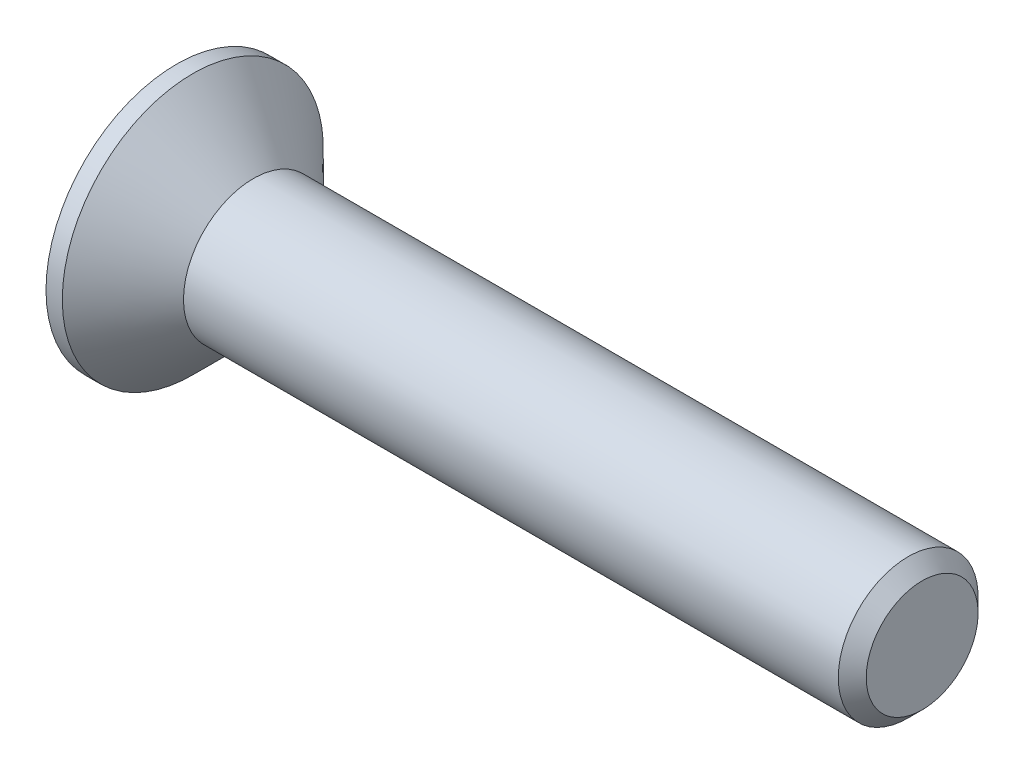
ISO-10303-21;
HEADER;
FILE_DESCRIPTION(('STEP AP214'),'2;1');
FILE_NAME('part.step','',(''),(''),'','','');
FILE_SCHEMA(('AUTOMOTIVE_DESIGN { 1 0 10303 214 1 1 1 1 }'));
ENDSEC;
DATA;
#1=APPLICATION_CONTEXT('core data for automotive mechanical design processes');
#2=APPLICATION_PROTOCOL_DEFINITION('international standard','automotive_design',2000,#1);
#3=PRODUCT_CONTEXT('',#1,'mechanical');
#4=PRODUCT('Part','Part','',(#3));
#5=PRODUCT_RELATED_PRODUCT_CATEGORY('part','',(#4));
#6=PRODUCT_DEFINITION_FORMATION('','',#4);
#7=PRODUCT_DEFINITION_CONTEXT('part definition',#1,'design');
#8=PRODUCT_DEFINITION('design','',#6,#7);
#9=PRODUCT_DEFINITION_SHAPE('','',#8);
#10=(LENGTH_UNIT() NAMED_UNIT(*) SI_UNIT(.MILLI.,.METRE.));
#11=(NAMED_UNIT(*) PLANE_ANGLE_UNIT() SI_UNIT($,.RADIAN.));
#12=(NAMED_UNIT(*) SI_UNIT($,.STERADIAN.) SOLID_ANGLE_UNIT());
#13=UNCERTAINTY_MEASURE_WITH_UNIT(LENGTH_MEASURE(1.E-05),#10,'distance_accuracy_value','');
#14=(GEOMETRIC_REPRESENTATION_CONTEXT(3) GLOBAL_UNCERTAINTY_ASSIGNED_CONTEXT((#13)) GLOBAL_UNIT_ASSIGNED_CONTEXT((#10,
#11,#12)) REPRESENTATION_CONTEXT('',''));
#15=CARTESIAN_POINT('',(0.,0.,0.));
#16=DIRECTION('',(0.,0.,1.));
#17=DIRECTION('',(1.,0.,0.));
#18=AXIS2_PLACEMENT_3D('',#15,#16,#17);
#19=CARTESIAN_POINT('',(0.,0.,0.));
#20=DIRECTION('',(-1.,0.,0.));
#21=DIRECTION('',(0.,0.,1.));
#22=AXIS2_PLACEMENT_3D('',#19,#20,#21);
#23=CONICAL_SURFACE('',#22,1.5,0.78539816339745);
#24=CARTESIAN_POINT('',(-1.3,0.,0.));
#25=DIRECTION('',(-1.,0.,0.));
#26=DIRECTION('',(0.,0.,1.));
#27=AXIS2_PLACEMENT_3D('',#24,#25,#26);
#28=CIRCLE('',#27,2.8);
#29=CARTESIAN_POINT('',(-1.3,0.,2.8));
#30=VERTEX_POINT('',#29);
#31=EDGE_CURVE('E189',#30,#30,#28,.T.);
#32=ORIENTED_EDGE('',*,*,#31,.F.);
#33=EDGE_LOOP('',(#32));
#34=FACE_BOUND('',#33,.T.);
#35=CARTESIAN_POINT('',(0.,0.,0.));
#36=DIRECTION('',(-1.,0.,0.));
#37=DIRECTION('',(0.,0.,1.));
#38=AXIS2_PLACEMENT_3D('',#35,#36,#37);
#39=CIRCLE('',#38,1.5);
#40=CARTESIAN_POINT('',(0.,0.,1.5));
#41=VERTEX_POINT('',#40);
#42=EDGE_CURVE('E212',#41,#41,#39,.T.);
#43=ORIENTED_EDGE('',*,*,#42,.T.);
#44=EDGE_LOOP('',(#43));
#45=FACE_BOUND('',#44,.T.);
#46=ADVANCED_FACE('F33',(#34,#45),#23,.T.);
#47=CARTESIAN_POINT('',(-1.65,0.,0.));
#48=DIRECTION('',(-1.,0.,0.));
#49=DIRECTION('',(0.,0.,1.));
#50=AXIS2_PLACEMENT_3D('',#47,#48,#49);
#51=CYLINDRICAL_SURFACE('',#50,1.5);
#52=CARTESIAN_POINT('',(14.05,0.,0.));
#53=DIRECTION('',(-1.,0.,0.));
#54=DIRECTION('',(0.,0.,1.));
#55=AXIS2_PLACEMENT_3D('',#52,#53,#54);
#56=CIRCLE('',#55,1.5);
#57=CARTESIAN_POINT('',(14.05,0.,1.5));
#58=VERTEX_POINT('',#57);
#59=EDGE_CURVE('E41',#58,#58,#56,.T.);
#60=ORIENTED_EDGE('',*,*,#59,.T.);
#61=EDGE_LOOP('',(#60));
#62=FACE_BOUND('',#61,.T.);
#63=ORIENTED_EDGE('',*,*,#42,.F.);
#64=EDGE_LOOP('',(#63));
#65=FACE_BOUND('',#64,.T.);
#66=ADVANCED_FACE('F217',(#62,#65),#51,.T.);
#67=CARTESIAN_POINT('',(14.35,0.,0.));
#68=DIRECTION('',(-1.,0.,0.));
#69=DIRECTION('',(0.,0.,1.));
#70=AXIS2_PLACEMENT_3D('',#67,#68,#69);
#71=PLANE('',#70);
#72=CARTESIAN_POINT('',(14.35,0.,0.));
#73=DIRECTION('',(-1.,0.,0.));
#74=DIRECTION('',(0.,0.,1.));
#75=AXIS2_PLACEMENT_3D('',#72,#73,#74);
#76=CIRCLE('',#75,1.19999999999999);
#77=CARTESIAN_POINT('',(14.35,0.,1.19999999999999));
#78=VERTEX_POINT('',#77);
#79=EDGE_CURVE('E11',#78,#78,#76,.F.);
#80=ORIENTED_EDGE('',*,*,#79,.T.);
#81=EDGE_LOOP('',(#80));
#82=FACE_BOUND('',#81,.T.);
#83=ADVANCED_FACE('F239',(#82),#71,.F.);
#84=CARTESIAN_POINT('',(-1.65,2.8,0.));
#85=DIRECTION('',(1.,0.,0.));
#86=DIRECTION('',(0.,0.,-1.));
#87=AXIS2_PLACEMENT_3D('',#84,#85,#86);
#88=PLANE('',#87);
#89=DIRECTION('',(0.,0.,-1.));
#90=VECTOR('',#89,1.);
#91=CARTESIAN_POINT('',(-1.65,0.365,-1.45));
#92=LINE('',#91,#90);
#93=CARTESIAN_POINT('',(-1.65,0.365,-0.365));
#94=VERTEX_POINT('',#93);
#95=CARTESIAN_POINT('',(-1.65,0.365,-1.45));
#96=VERTEX_POINT('',#95);
#97=EDGE_CURVE('E158',#94,#96,#92,.T.);
#98=ORIENTED_EDGE('',*,*,#97,.F.);
#99=DIRECTION('',(0.,-1.,0.));
#100=VECTOR('',#99,1.);
#101=CARTESIAN_POINT('',(-1.65,0.365,-0.365));
#102=LINE('',#101,#100);
#103=CARTESIAN_POINT('',(-1.65,1.45,-0.365));
#104=VERTEX_POINT('',#103);
#105=EDGE_CURVE('E48',#104,#94,#102,.T.);
#106=ORIENTED_EDGE('',*,*,#105,.F.);
#107=DIRECTION('',(0.,0.,-1.));
#108=VECTOR('',#107,1.);
#109=CARTESIAN_POINT('',(-1.65,1.45,-0.365));
#110=LINE('',#109,#108);
#111=CARTESIAN_POINT('',(-1.65,1.45,0.365));
#112=VERTEX_POINT('',#111);
#113=EDGE_CURVE('E185',#112,#104,#110,.T.);
#114=ORIENTED_EDGE('',*,*,#113,.F.);
#115=DIRECTION('',(0.,1.,0.));
#116=VECTOR('',#115,1.);
#117=CARTESIAN_POINT('',(-1.65,1.45,0.365));
#118=LINE('',#117,#116);
#119=CARTESIAN_POINT('',(-1.65,0.365,0.365));
#120=VERTEX_POINT('',#119);
#121=EDGE_CURVE('E183',#120,#112,#118,.T.);
#122=ORIENTED_EDGE('',*,*,#121,.F.);
#123=DIRECTION('',(0.,0.,-1.));
#124=VECTOR('',#123,1.);
#125=CARTESIAN_POINT('',(-1.65,0.365,0.365));
#126=LINE('',#125,#124);
#127=CARTESIAN_POINT('',(-1.65,0.365,1.45));
#128=VERTEX_POINT('',#127);
#129=EDGE_CURVE('E132',#128,#120,#126,.T.);
#130=ORIENTED_EDGE('',*,*,#129,.F.);
#131=DIRECTION('',(0.,1.,0.));
#132=VECTOR('',#131,1.);
#133=CARTESIAN_POINT('',(-1.65,0.365,1.45));
#134=LINE('',#133,#132);
#135=CARTESIAN_POINT('',(-1.65,-0.365,1.45));
#136=VERTEX_POINT('',#135);
#137=EDGE_CURVE('E179',#136,#128,#134,.T.);
#138=ORIENTED_EDGE('',*,*,#137,.F.);
#139=DIRECTION('',(0.,0.,1.));
#140=VECTOR('',#139,1.);
#141=CARTESIAN_POINT('',(-1.65,-0.365,1.45));
#142=LINE('',#141,#140);
#143=CARTESIAN_POINT('',(-1.65,-0.365,0.365));
#144=VERTEX_POINT('',#143);
#145=EDGE_CURVE('E176',#144,#136,#142,.T.);
#146=ORIENTED_EDGE('',*,*,#145,.F.);
#147=DIRECTION('',(0.,1.,0.));
#148=VECTOR('',#147,1.);
#149=CARTESIAN_POINT('',(-1.65,-0.365,0.365));
#150=LINE('',#149,#148);
#151=CARTESIAN_POINT('',(-1.65,-1.45,0.365));
#152=VERTEX_POINT('',#151);
#153=EDGE_CURVE('E173',#152,#144,#150,.T.);
#154=ORIENTED_EDGE('',*,*,#153,.F.);
#155=DIRECTION('',(0.,0.,1.));
#156=VECTOR('',#155,1.);
#157=CARTESIAN_POINT('',(-1.65,-1.45,0.365));
#158=LINE('',#157,#156);
#159=CARTESIAN_POINT('',(-1.65,-1.45,-0.365));
#160=VERTEX_POINT('',#159);
#161=EDGE_CURVE('E170',#160,#152,#158,.T.);
#162=ORIENTED_EDGE('',*,*,#161,.F.);
#163=DIRECTION('',(0.,-1.,0.));
#164=VECTOR('',#163,1.);
#165=CARTESIAN_POINT('',(-1.65,-1.45,-0.365));
#166=LINE('',#165,#164);
#167=CARTESIAN_POINT('',(-1.65,-0.365,-0.365));
#168=VERTEX_POINT('',#167);
#169=EDGE_CURVE('E167',#168,#160,#166,.T.);
#170=ORIENTED_EDGE('',*,*,#169,.F.);
#171=DIRECTION('',(0.,0.,1.));
#172=VECTOR('',#171,1.);
#173=CARTESIAN_POINT('',(-1.65,-0.365,-0.365));
#174=LINE('',#173,#172);
#175=CARTESIAN_POINT('',(-1.65,-0.365,-1.45));
#176=VERTEX_POINT('',#175);
#177=EDGE_CURVE('E164',#176,#168,#174,.T.);
#178=ORIENTED_EDGE('',*,*,#177,.F.);
#179=DIRECTION('',(0.,-1.,0.));
#180=VECTOR('',#179,1.);
#181=CARTESIAN_POINT('',(-1.65,-0.365,-1.45));
#182=LINE('',#181,#180);
#183=EDGE_CURVE('E161',#96,#176,#182,.T.);
#184=ORIENTED_EDGE('',*,*,#183,.F.);
#185=EDGE_LOOP('',(#98,#106,#114,#122,#130,#138,#146,#154,#162,#170,#178,#184));
#186=FACE_BOUND('',#185,.T.);
#187=CARTESIAN_POINT('',(-1.65,0.,0.));
#188=DIRECTION('',(-1.,0.,0.));
#189=DIRECTION('',(0.,0.,1.));
#190=AXIS2_PLACEMENT_3D('',#187,#188,#189);
#191=CIRCLE('',#190,2.8);
#192=CARTESIAN_POINT('',(-1.65,0.,2.8));
#193=VERTEX_POINT('',#192);
#194=EDGE_CURVE('E209',#193,#193,#191,.T.);
#195=ORIENTED_EDGE('',*,*,#194,.T.);
#196=EDGE_LOOP('',(#195));
#197=FACE_BOUND('',#196,.T.);
#198=ADVANCED_FACE('F230',(#186,#197),#88,.F.);
#199=CARTESIAN_POINT('',(-1.65,0.,0.));
#200=DIRECTION('',(-1.,0.,0.));
#201=DIRECTION('',(0.,0.,1.));
#202=AXIS2_PLACEMENT_3D('',#199,#200,#201);
#203=CYLINDRICAL_SURFACE('',#202,2.8);
#204=ORIENTED_EDGE('',*,*,#194,.F.);
#205=EDGE_LOOP('',(#204));
#206=FACE_BOUND('',#205,.T.);
#207=ORIENTED_EDGE('',*,*,#31,.T.);
#208=EDGE_LOOP('',(#207));
#209=FACE_BOUND('',#208,.T.);
#210=ADVANCED_FACE('F222',(#206,#209),#203,.T.);
#211=CARTESIAN_POINT('',(14.05,0.,0.));
#212=DIRECTION('',(-1.,0.,0.));
#213=DIRECTION('',(0.,0.,1.));
#214=AXIS2_PLACEMENT_3D('',#211,#212,#213);
#215=CONICAL_SURFACE('',#214,1.5,0.785398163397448);
#216=CARTESIAN_POINT('',(14.35,0.,1.19999999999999));
#217=CARTESIAN_POINT('',(14.346875,0.,1.20312499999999));
#218=CARTESIAN_POINT('',(14.34375,0.,1.20624999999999));
#219=CARTESIAN_POINT('',(14.3375,0.,1.21249999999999));
#220=CARTESIAN_POINT('',(14.334375,0.,1.21562499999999));
#221=CARTESIAN_POINT('',(14.328125,0.,1.22187499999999));
#222=CARTESIAN_POINT('',(14.325,0.,1.22499999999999));
#223=CARTESIAN_POINT('',(14.31875,0.,1.23124999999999));
#224=CARTESIAN_POINT('',(14.315625,0.,1.23437499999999));
#225=CARTESIAN_POINT('',(14.309375,0.,1.24062499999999));
#226=CARTESIAN_POINT('',(14.30625,0.,1.24374999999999));
#227=CARTESIAN_POINT('',(14.3,0.,1.24999999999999));
#228=CARTESIAN_POINT('',(14.296875,0.,1.25312499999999));
#229=CARTESIAN_POINT('',(14.290625,0.,1.25937499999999));
#230=CARTESIAN_POINT('',(14.2875,0.,1.2625));
#231=CARTESIAN_POINT('',(14.28125,0.,1.26875));
#232=CARTESIAN_POINT('',(14.278125,0.,1.271875));
#233=CARTESIAN_POINT('',(14.271875,0.,1.278125));
#234=CARTESIAN_POINT('',(14.26875,0.,1.28124999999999));
#235=CARTESIAN_POINT('',(14.2625,0.,1.28749999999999));
#236=CARTESIAN_POINT('',(14.259375,0.,1.290625));
#237=CARTESIAN_POINT('',(14.253125,0.,1.296875));
#238=CARTESIAN_POINT('',(14.25,0.,1.3));
#239=CARTESIAN_POINT('',(14.24375,0.,1.30625));
#240=CARTESIAN_POINT('',(14.240625,0.,1.309375));
#241=CARTESIAN_POINT('',(14.234375,0.,1.315625));
#242=CARTESIAN_POINT('',(14.23125,0.,1.31875));
#243=CARTESIAN_POINT('',(14.225,0.,1.325));
#244=CARTESIAN_POINT('',(14.221875,0.,1.328125));
#245=CARTESIAN_POINT('',(14.215625,0.,1.334375));
#246=CARTESIAN_POINT('',(14.2125,0.,1.3375));
#247=CARTESIAN_POINT('',(14.20625,0.,1.34375));
#248=CARTESIAN_POINT('',(14.203125,0.,1.346875));
#249=CARTESIAN_POINT('',(14.196875,0.,1.353125));
#250=CARTESIAN_POINT('',(14.19375,0.,1.35625));
#251=CARTESIAN_POINT('',(14.1875,0.,1.3625));
#252=CARTESIAN_POINT('',(14.184375,0.,1.365625));
#253=CARTESIAN_POINT('',(14.178125,0.,1.371875));
#254=CARTESIAN_POINT('',(14.175,0.,1.375));
#255=CARTESIAN_POINT('',(14.16875,0.,1.38125));
#256=CARTESIAN_POINT('',(14.165625,0.,1.384375));
#257=CARTESIAN_POINT('',(14.159375,0.,1.390625));
#258=CARTESIAN_POINT('',(14.15625,0.,1.39375));
#259=CARTESIAN_POINT('',(14.15,0.,1.4));
#260=CARTESIAN_POINT('',(14.146875,0.,1.403125));
#261=CARTESIAN_POINT('',(14.140625,0.,1.409375));
#262=CARTESIAN_POINT('',(14.1375,0.,1.4125));
#263=CARTESIAN_POINT('',(14.13125,0.,1.41875));
#264=CARTESIAN_POINT('',(14.128125,0.,1.421875));
#265=CARTESIAN_POINT('',(14.121875,0.,1.428125));
#266=CARTESIAN_POINT('',(14.11875,0.,1.43125));
#267=CARTESIAN_POINT('',(14.1125,0.,1.4375));
#268=CARTESIAN_POINT('',(14.109375,0.,1.440625));
#269=CARTESIAN_POINT('',(14.103125,0.,1.446875));
#270=CARTESIAN_POINT('',(14.1,0.,1.45));
#271=CARTESIAN_POINT('',(14.09375,0.,1.45625));
#272=CARTESIAN_POINT('',(14.090625,0.,1.459375));
#273=CARTESIAN_POINT('',(14.084375,0.,1.465625));
#274=CARTESIAN_POINT('',(14.08125,0.,1.46875));
#275=CARTESIAN_POINT('',(14.075,0.,1.475));
#276=CARTESIAN_POINT('',(14.071875,0.,1.478125));
#277=CARTESIAN_POINT('',(14.065625,0.,1.484375));
#278=CARTESIAN_POINT('',(14.0625,0.,1.4875));
#279=CARTESIAN_POINT('',(14.05625,0.,1.49375));
#280=CARTESIAN_POINT('',(14.053125,0.,1.496875));
#281=CARTESIAN_POINT('',(14.05,0.,1.5));
#282=B_SPLINE_CURVE_WITH_KNOTS('',3,(#216,#217,#218,#219,#220,#221,#222,#223,#224,#225,#226,
#227,#228,#229,#230,#231,#232,#233,#234,#235,#236,#237,#238,#239,#240,#241,#242,#243,#244,#245,
#246,#247,#248,#249,#250,#251,#252,#253,#254,#255,#256,#257,#258,#259,#260,#261,#262,#263,#264,
#265,#266,#267,#268,#269,#270,#271,#272,#273,#274,#275,#276,#277,#278,#279,#280,#281),
.UNSPECIFIED.,.F.,.F.,(4,2,2,2,2,2,2,2,2,2,2,2,2,2,2,2,2,2,2,2,2,2,2,2,2,2,2,2,2,2,2,2,4),(0.,
0.0132582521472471,0.0265165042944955,0.039774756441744,0.0530330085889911,0.0662912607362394,
0.0795495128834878,0.092807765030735,0.106066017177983,0.119324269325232,0.132582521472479,
0.145840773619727,0.159099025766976,0.172357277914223,0.185615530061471,0.19887378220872,
0.212132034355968,0.225390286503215,0.238648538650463,0.251906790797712,0.265165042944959,
0.278423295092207,0.291681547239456,0.304939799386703,0.318198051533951,0.3314563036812,
0.344714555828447,0.357972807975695,0.371231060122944,0.384489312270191,0.397747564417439,
0.411005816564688,0.424264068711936),.UNSPECIFIED.);
#283=EDGE_CURVE('BSEAM35',#78,#58,#282,.T.);
#284=ORIENTED_EDGE('',*,*,#79,.F.);
#285=ORIENTED_EDGE('',*,*,#59,.F.);
#286=ORIENTED_EDGE('',*,*,#283,.T.);
#287=ORIENTED_EDGE('',*,*,#283,.F.);
#288=EDGE_LOOP('',(#284,#286,#285,#287));
#289=FACE_BOUND('',#288,.T.);
#290=ADVANCED_FACE('F35',(#289),#215,.T.);
#291=CARTESIAN_POINT('',(-0.4,0.365,-0.365));
#292=DIRECTION('',(0.,0.,-1.));
#293=DIRECTION('',(-1.,0.,0.));
#294=AXIS2_PLACEMENT_3D('',#291,#292,#293);
#295=PLANE('',#294);
#296=ORIENTED_EDGE('',*,*,#105,.T.);
#297=DIRECTION('',(-1.,0.,0.));
#298=VECTOR('',#297,1.);
#299=CARTESIAN_POINT('',(-0.4,0.365,-0.365));
#300=LINE('',#299,#298);
#301=CARTESIAN_POINT('',(-0.4,0.365,-0.365));
#302=VERTEX_POINT('',#301);
#303=EDGE_CURVE('E96',#302,#94,#300,.T.);
#304=ORIENTED_EDGE('',*,*,#303,.F.);
#305=DIRECTION('',(0.,-1.,0.));
#306=VECTOR('',#305,1.);
#307=CARTESIAN_POINT('',(-0.4,0.365,-0.365));
#308=LINE('',#307,#306);
#309=CARTESIAN_POINT('',(-0.4,1.45,-0.365));
#310=VERTEX_POINT('',#309);
#311=EDGE_CURVE('E187',#310,#302,#308,.T.);
#312=ORIENTED_EDGE('',*,*,#311,.F.);
#313=DIRECTION('',(-1.,0.,0.));
#314=VECTOR('',#313,1.);
#315=CARTESIAN_POINT('',(-0.4,1.45,-0.365));
#316=LINE('',#315,#314);
#317=EDGE_CURVE('E56',#310,#104,#316,.T.);
#318=ORIENTED_EDGE('',*,*,#317,.T.);
#319=EDGE_LOOP('',(#296,#304,#312,#318));
#320=FACE_BOUND('',#319,.T.);
#321=ADVANCED_FACE('F221',(#320),#295,.F.);
#322=CARTESIAN_POINT('',(-0.4,1.45,-0.365));
#323=DIRECTION('',(0.,1.,0.));
#324=DIRECTION('',(-1.,0.,0.));
#325=AXIS2_PLACEMENT_3D('',#322,#323,#324);
#326=PLANE('',#325);
#327=ORIENTED_EDGE('',*,*,#113,.T.);
#328=ORIENTED_EDGE('',*,*,#317,.F.);
#329=DIRECTION('',(0.,0.,-1.));
#330=VECTOR('',#329,1.);
#331=CARTESIAN_POINT('',(-0.4,1.45,-0.365));
#332=LINE('',#331,#330);
#333=CARTESIAN_POINT('',(-0.4,1.45,0.365));
#334=VERTEX_POINT('',#333);
#335=EDGE_CURVE('E144',#334,#310,#332,.T.);
#336=ORIENTED_EDGE('',*,*,#335,.F.);
#337=DIRECTION('',(-1.,0.,0.));
#338=VECTOR('',#337,1.);
#339=CARTESIAN_POINT('',(-0.4,1.45,0.365));
#340=LINE('',#339,#338);
#341=EDGE_CURVE('E136',#334,#112,#340,.T.);
#342=ORIENTED_EDGE('',*,*,#341,.T.);
#343=EDGE_LOOP('',(#327,#328,#336,#342));
#344=FACE_BOUND('',#343,.T.);
#345=ADVANCED_FACE('F228',(#344),#326,.F.);
#346=CARTESIAN_POINT('',(-0.4,1.45,0.365));
#347=DIRECTION('',(0.,0.,1.));
#348=DIRECTION('',(1.,0.,0.));
#349=AXIS2_PLACEMENT_3D('',#346,#347,#348);
#350=PLANE('',#349);
#351=ORIENTED_EDGE('',*,*,#121,.T.);
#352=ORIENTED_EDGE('',*,*,#341,.F.);
#353=DIRECTION('',(0.,1.,0.));
#354=VECTOR('',#353,1.);
#355=CARTESIAN_POINT('',(-0.4,1.45,0.365));
#356=LINE('',#355,#354);
#357=CARTESIAN_POINT('',(-0.4,0.365,0.365));
#358=VERTEX_POINT('',#357);
#359=EDGE_CURVE('E140',#358,#334,#356,.T.);
#360=ORIENTED_EDGE('',*,*,#359,.F.);
#361=DIRECTION('',(-1.,0.,0.));
#362=VECTOR('',#361,1.);
#363=CARTESIAN_POINT('',(-0.4,0.365,0.365));
#364=LINE('',#363,#362);
#365=EDGE_CURVE('E125',#358,#120,#364,.T.);
#366=ORIENTED_EDGE('',*,*,#365,.T.);
#367=EDGE_LOOP('',(#351,#352,#360,#366));
#368=FACE_BOUND('',#367,.T.);
#369=ADVANCED_FACE('F141',(#368),#350,.F.);
#370=CARTESIAN_POINT('',(-0.4,0.365,0.365));
#371=DIRECTION('',(0.,1.,0.));
#372=DIRECTION('',(-1.,0.,0.));
#373=AXIS2_PLACEMENT_3D('',#370,#371,#372);
#374=PLANE('',#373);
#375=ORIENTED_EDGE('',*,*,#129,.T.);
#376=ORIENTED_EDGE('',*,*,#365,.F.);
#377=DIRECTION('',(0.,0.,-1.));
#378=VECTOR('',#377,1.);
#379=CARTESIAN_POINT('',(-0.4,0.365,0.365));
#380=LINE('',#379,#378);
#381=CARTESIAN_POINT('',(-0.4,0.365,1.45));
#382=VERTEX_POINT('',#381);
#383=EDGE_CURVE('E129',#382,#358,#380,.T.);
#384=ORIENTED_EDGE('',*,*,#383,.F.);
#385=DIRECTION('',(-1.,0.,0.));
#386=VECTOR('',#385,1.);
#387=CARTESIAN_POINT('',(-0.4,0.365,1.45));
#388=LINE('',#387,#386);
#389=EDGE_CURVE('E137',#382,#128,#388,.T.);
#390=ORIENTED_EDGE('',*,*,#389,.T.);
#391=EDGE_LOOP('',(#375,#376,#384,#390));
#392=FACE_BOUND('',#391,.T.);
#393=ADVANCED_FACE('F127',(#392),#374,.F.);
#394=CARTESIAN_POINT('',(-0.4,0.365,1.45));
#395=DIRECTION('',(0.,0.,1.));
#396=DIRECTION('',(1.,0.,0.));
#397=AXIS2_PLACEMENT_3D('',#394,#395,#396);
#398=PLANE('',#397);
#399=ORIENTED_EDGE('',*,*,#137,.T.);
#400=ORIENTED_EDGE('',*,*,#389,.F.);
#401=DIRECTION('',(0.,1.,0.));
#402=VECTOR('',#401,1.);
#403=CARTESIAN_POINT('',(-0.4,0.365,1.45));
#404=LINE('',#403,#402);
#405=CARTESIAN_POINT('',(-0.4,-0.365,1.45));
#406=VERTEX_POINT('',#405);
#407=EDGE_CURVE('E150',#406,#382,#404,.T.);
#408=ORIENTED_EDGE('',*,*,#407,.F.);
#409=DIRECTION('',(-1.,0.,0.));
#410=VECTOR('',#409,1.);
#411=CARTESIAN_POINT('',(-0.4,-0.365,1.45));
#412=LINE('',#411,#410);
#413=EDGE_CURVE('E192',#406,#136,#412,.T.);
#414=ORIENTED_EDGE('',*,*,#413,.T.);
#415=EDGE_LOOP('',(#399,#400,#408,#414));
#416=FACE_BOUND('',#415,.T.);
#417=ADVANCED_FACE('F277',(#416),#398,.F.);
#418=CARTESIAN_POINT('',(-0.4,-0.365,1.45));
#419=DIRECTION('',(0.,-1.,0.));
#420=DIRECTION('',(1.,0.,0.));
#421=AXIS2_PLACEMENT_3D('',#418,#419,#420);
#422=PLANE('',#421);
#423=ORIENTED_EDGE('',*,*,#145,.T.);
#424=ORIENTED_EDGE('',*,*,#413,.F.);
#425=DIRECTION('',(0.,0.,1.));
#426=VECTOR('',#425,1.);
#427=CARTESIAN_POINT('',(-0.4,-0.365,1.45));
#428=LINE('',#427,#426);
#429=CARTESIAN_POINT('',(-0.4,-0.365,0.365));
#430=VERTEX_POINT('',#429);
#431=EDGE_CURVE('E152',#430,#406,#428,.T.);
#432=ORIENTED_EDGE('',*,*,#431,.F.);
#433=DIRECTION('',(-1.,0.,0.));
#434=VECTOR('',#433,1.);
#435=CARTESIAN_POINT('',(-0.4,-0.365,0.365));
#436=LINE('',#435,#434);
#437=EDGE_CURVE('E194',#430,#144,#436,.T.);
#438=ORIENTED_EDGE('',*,*,#437,.T.);
#439=EDGE_LOOP('',(#423,#424,#432,#438));
#440=FACE_BOUND('',#439,.T.);
#441=ADVANCED_FACE('F273',(#440),#422,.F.);
#442=CARTESIAN_POINT('',(-0.4,-0.365,0.365));
#443=DIRECTION('',(0.,0.,1.));
#444=DIRECTION('',(1.,0.,0.));
#445=AXIS2_PLACEMENT_3D('',#442,#443,#444);
#446=PLANE('',#445);
#447=ORIENTED_EDGE('',*,*,#153,.T.);
#448=ORIENTED_EDGE('',*,*,#437,.F.);
#449=DIRECTION('',(0.,1.,0.));
#450=VECTOR('',#449,1.);
#451=CARTESIAN_POINT('',(-0.4,-0.365,0.365));
#452=LINE('',#451,#450);
#453=CARTESIAN_POINT('',(-0.4,-1.45,0.365));
#454=VERTEX_POINT('',#453);
#455=EDGE_CURVE('E422',#454,#430,#452,.T.);
#456=ORIENTED_EDGE('',*,*,#455,.F.);
#457=DIRECTION('',(-1.,0.,0.));
#458=VECTOR('',#457,1.);
#459=CARTESIAN_POINT('',(-0.4,-1.45,0.365));
#460=LINE('',#459,#458);
#461=EDGE_CURVE('E196',#454,#152,#460,.T.);
#462=ORIENTED_EDGE('',*,*,#461,.T.);
#463=EDGE_LOOP('',(#447,#448,#456,#462));
#464=FACE_BOUND('',#463,.T.);
#465=ADVANCED_FACE('F269',(#464),#446,.F.);
#466=CARTESIAN_POINT('',(-0.4,-1.45,0.365));
#467=DIRECTION('',(0.,-1.,0.));
#468=DIRECTION('',(1.,0.,0.));
#469=AXIS2_PLACEMENT_3D('',#466,#467,#468);
#470=PLANE('',#469);
#471=ORIENTED_EDGE('',*,*,#161,.T.);
#472=ORIENTED_EDGE('',*,*,#461,.F.);
#473=DIRECTION('',(0.,0.,1.));
#474=VECTOR('',#473,1.);
#475=CARTESIAN_POINT('',(-0.4,-1.45,0.365));
#476=LINE('',#475,#474);
#477=CARTESIAN_POINT('',(-0.4,-1.45,-0.365));
#478=VERTEX_POINT('',#477);
#479=EDGE_CURVE('E419',#478,#454,#476,.T.);
#480=ORIENTED_EDGE('',*,*,#479,.F.);
#481=DIRECTION('',(-1.,0.,0.));
#482=VECTOR('',#481,1.);
#483=CARTESIAN_POINT('',(-0.4,-1.45,-0.365));
#484=LINE('',#483,#482);
#485=EDGE_CURVE('E198',#478,#160,#484,.T.);
#486=ORIENTED_EDGE('',*,*,#485,.T.);
#487=EDGE_LOOP('',(#471,#472,#480,#486));
#488=FACE_BOUND('',#487,.T.);
#489=ADVANCED_FACE('F265',(#488),#470,.F.);
#490=CARTESIAN_POINT('',(-0.4,-1.45,-0.365));
#491=DIRECTION('',(0.,0.,-1.));
#492=DIRECTION('',(-1.,0.,0.));
#493=AXIS2_PLACEMENT_3D('',#490,#491,#492);
#494=PLANE('',#493);
#495=ORIENTED_EDGE('',*,*,#169,.T.);
#496=ORIENTED_EDGE('',*,*,#485,.F.);
#497=DIRECTION('',(0.,-1.,0.));
#498=VECTOR('',#497,1.);
#499=CARTESIAN_POINT('',(-0.4,-1.45,-0.365));
#500=LINE('',#499,#498);
#501=CARTESIAN_POINT('',(-0.4,-0.365,-0.365));
#502=VERTEX_POINT('',#501);
#503=EDGE_CURVE('E416',#502,#478,#500,.T.);
#504=ORIENTED_EDGE('',*,*,#503,.F.);
#505=DIRECTION('',(-1.,0.,0.));
#506=VECTOR('',#505,1.);
#507=CARTESIAN_POINT('',(-0.4,-0.365,-0.365));
#508=LINE('',#507,#506);
#509=EDGE_CURVE('E200',#502,#168,#508,.T.);
#510=ORIENTED_EDGE('',*,*,#509,.T.);
#511=EDGE_LOOP('',(#495,#496,#504,#510));
#512=FACE_BOUND('',#511,.T.);
#513=ADVANCED_FACE('F261',(#512),#494,.F.);
#514=CARTESIAN_POINT('',(-0.4,-0.365,-0.365));
#515=DIRECTION('',(0.,-1.,0.));
#516=DIRECTION('',(1.,0.,0.));
#517=AXIS2_PLACEMENT_3D('',#514,#515,#516);
#518=PLANE('',#517);
#519=ORIENTED_EDGE('',*,*,#177,.T.);
#520=ORIENTED_EDGE('',*,*,#509,.F.);
#521=DIRECTION('',(0.,0.,1.));
#522=VECTOR('',#521,1.);
#523=CARTESIAN_POINT('',(-0.4,-0.365,-0.365));
#524=LINE('',#523,#522);
#525=CARTESIAN_POINT('',(-0.4,-0.365,-1.45));
#526=VERTEX_POINT('',#525);
#527=EDGE_CURVE('E413',#526,#502,#524,.T.);
#528=ORIENTED_EDGE('',*,*,#527,.F.);
#529=DIRECTION('',(-1.,0.,0.));
#530=VECTOR('',#529,1.);
#531=CARTESIAN_POINT('',(-0.4,-0.365,-1.45));
#532=LINE('',#531,#530);
#533=EDGE_CURVE('E202',#526,#176,#532,.T.);
#534=ORIENTED_EDGE('',*,*,#533,.T.);
#535=EDGE_LOOP('',(#519,#520,#528,#534));
#536=FACE_BOUND('',#535,.T.);
#537=ADVANCED_FACE('F257',(#536),#518,.F.);
#538=CARTESIAN_POINT('',(-0.4,-0.365,-1.45));
#539=DIRECTION('',(0.,0.,-1.));
#540=DIRECTION('',(-1.,0.,0.));
#541=AXIS2_PLACEMENT_3D('',#538,#539,#540);
#542=PLANE('',#541);
#543=ORIENTED_EDGE('',*,*,#183,.T.);
#544=ORIENTED_EDGE('',*,*,#533,.F.);
#545=DIRECTION('',(0.,-1.,0.));
#546=VECTOR('',#545,1.);
#547=CARTESIAN_POINT('',(-0.4,-0.365,-1.45));
#548=LINE('',#547,#546);
#549=CARTESIAN_POINT('',(-0.4,0.365,-1.45));
#550=VERTEX_POINT('',#549);
#551=EDGE_CURVE('E408',#550,#526,#548,.T.);
#552=ORIENTED_EDGE('',*,*,#551,.F.);
#553=DIRECTION('',(-1.,0.,0.));
#554=VECTOR('',#553,1.);
#555=CARTESIAN_POINT('',(-0.4,0.365,-1.45));
#556=LINE('',#555,#554);
#557=EDGE_CURVE('E204',#550,#96,#556,.T.);
#558=ORIENTED_EDGE('',*,*,#557,.T.);
#559=EDGE_LOOP('',(#543,#544,#552,#558));
#560=FACE_BOUND('',#559,.T.);
#561=ADVANCED_FACE('F253',(#560),#542,.F.);
#562=CARTESIAN_POINT('',(-0.4,0.365,-1.45));
#563=DIRECTION('',(0.,1.,0.));
#564=DIRECTION('',(-1.,0.,0.));
#565=AXIS2_PLACEMENT_3D('',#562,#563,#564);
#566=PLANE('',#565);
#567=ORIENTED_EDGE('',*,*,#97,.T.);
#568=ORIENTED_EDGE('',*,*,#557,.F.);
#569=DIRECTION('',(0.,0.,-1.));
#570=VECTOR('',#569,1.);
#571=CARTESIAN_POINT('',(-0.4,0.365,-1.45));
#572=LINE('',#571,#570);
#573=EDGE_CURVE('E406',#302,#550,#572,.T.);
#574=ORIENTED_EDGE('',*,*,#573,.F.);
#575=ORIENTED_EDGE('',*,*,#303,.T.);
#576=EDGE_LOOP('',(#567,#568,#574,#575));
#577=FACE_BOUND('',#576,.T.);
#578=ADVANCED_FACE('F250',(#577),#566,.F.);
#579=CARTESIAN_POINT('',(-0.4,0.,0.));
#580=DIRECTION('',(1.,0.,0.));
#581=DIRECTION('',(0.,0.,-1.));
#582=AXIS2_PLACEMENT_3D('',#579,#580,#581);
#583=PLANE('',#582);
#584=ORIENTED_EDGE('',*,*,#311,.T.);
#585=ORIENTED_EDGE('',*,*,#573,.T.);
#586=ORIENTED_EDGE('',*,*,#551,.T.);
#587=ORIENTED_EDGE('',*,*,#527,.T.);
#588=ORIENTED_EDGE('',*,*,#503,.T.);
#589=ORIENTED_EDGE('',*,*,#479,.T.);
#590=ORIENTED_EDGE('',*,*,#455,.T.);
#591=ORIENTED_EDGE('',*,*,#431,.T.);
#592=ORIENTED_EDGE('',*,*,#407,.T.);
#593=ORIENTED_EDGE('',*,*,#383,.T.);
#594=ORIENTED_EDGE('',*,*,#359,.T.);
#595=ORIENTED_EDGE('',*,*,#335,.T.);
#596=EDGE_LOOP('',(#584,#585,#586,#587,#588,#589,#590,#591,#592,#593,#594,#595));
#597=FACE_BOUND('',#596,.T.);
#598=ADVANCED_FACE('F147',(#597),#583,.F.);
#599=CLOSED_SHELL('',(#46,#66,#83,#198,#210,#290,#321,#345,#369,#393,#417,#441,#465,#489,#513,
#537,#561,#578,#598));
#600=MANIFOLD_SOLID_BREP('B2',#599);
#601=ADVANCED_BREP_SHAPE_REPRESENTATION('',(#18,#600),#14);
#602=SHAPE_DEFINITION_REPRESENTATION(#9,#601);
ENDSEC;
END-ISO-10303-21;
